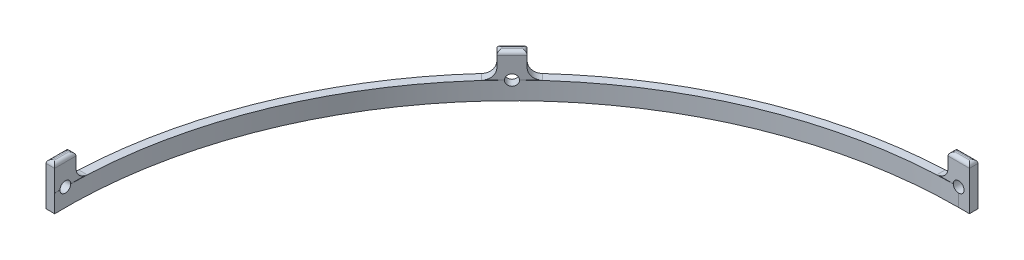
from build123d import *

# Parameters (mm, degrees)
EXTRUDE_1_DEPTH          = 5
SKETCH_2_W               = 2.4
SKETCH_2_H               = 6
SKETCH_2_W_2             = 6
SKETCH_2_H_2             = 2.4
EXTRUDE_2_DEPTH          = 12
FILLET_1_R               = 3
FILLET_2_R               = 3
FILLET_3_R               = 3
FILLET_4_R               = 3
FILLET_5_R               = 3
FILLET_6_R               = 3
FILLET_7_R               = 3
FILLET_8_R               = 3
SKETCH_4_R               = 1.5
CUT_EXTRUDE_1_DEPTH      = 3
PATTERN_CIRCULAR_2_COUNT = 5
PATTERN_CIRCULAR_2_ANGLE = 180
FILLET_9_R               = 1
SKETCH_5_W               = 130.4
SKETCH_5_H               = 124.4
CUT_EXTRUDE_2_DEPTH      = 181.569986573


with BuildPart() as part:
    # Sketch 1 → Extrude 1 (new body)
    with BuildSketch(Plane(origin=(0, 0, 0), x_dir=(1, 0, 0), z_dir=(0, 1, 0))):
        with BuildLine():
            Line((0, 125), (3, 125))
            Line((3, 125), (3, 127.4))
            Line((3, 127.4), (0, 127.4))
            ThreePointArc((0, 127.4), (-127.4, 0), (0, -127.4))
            Line((0, -127.4), (3, -127.4))
            Line((3, -127.4), (3, -125))
            Line((3, -125), (0, -125))
            ThreePointArc((0, -125), (-125, 0), (0, 125))
        make_face()
    extrude(amount=EXTRUDE_1_DEPTH)

    # Sketch 2 → Extrude 2 (add)
    with BuildSketch(Plane(origin=(0, 0, 0), x_dir=(1, 0, 0), z_dir=(0, 1, 0))):
        Polygon((-87.96408358, 92.206724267), (-92.206724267, 87.96408358), (-90.509667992, 86.267027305), (-86.267027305, 90.509667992), align=None)
        with Locations((-126.2, 0)):
            Rectangle(SKETCH_2_W, SKETCH_2_H)
        with Locations((0, 126.2)):
            Rectangle(SKETCH_2_W_2, SKETCH_2_H_2)
        Polygon((-92.206724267, -87.96408358), (-87.96408358, -92.206724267), (-86.267027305, -90.509667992), (-90.509667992, -86.267027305), align=None)
        with Locations((0, -126.2)):
            Rectangle(SKETCH_2_W_2, SKETCH_2_H_2)
    extrude(amount=EXTRUDE_2_DEPTH)

    # Fillet 1
    fillet_1_edges = [part.edges().sort_by_distance(p)[0] for p in [
        (-3, 5, 126.182336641),
    ]]
    fillet(fillet_1_edges, radius=FILLET_1_R)

    # Fillet 2
    fillet_2_edges = [part.edges().sort_by_distance(p)[0] for p in [
        (-87.103065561, 5, 91.345706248),
    ]]
    fillet(fillet_2_edges, radius=FILLET_2_R)

    # Fillet 3
    fillet_3_edges = [part.edges().sort_by_distance(p)[0] for p in [
        (-91.345706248, 5, 87.103065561),
    ]]
    fillet(fillet_3_edges, radius=FILLET_3_R)

    # Fillet 4
    fillet_4_edges = [part.edges().sort_by_distance(p)[0] for p in [
        (-126.182336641, 5, 3),
    ]]
    fillet(fillet_4_edges, radius=FILLET_4_R)

    # Fillet 5
    fillet_5_edges = [part.edges().sort_by_distance(p)[0] for p in [
        (-126.182336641, 5, -3),
    ]]
    fillet(fillet_5_edges, radius=FILLET_5_R)

    # Fillet 6
    fillet_6_edges = [part.edges().sort_by_distance(p)[0] for p in [
        (-91.345706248, 5, -87.103065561),
    ]]
    fillet(fillet_6_edges, radius=FILLET_6_R)

    # Fillet 7
    fillet_7_edges = [part.edges().sort_by_distance(p)[0] for p in [
        (-87.103065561, 5, -91.345706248),
    ]]
    fillet(fillet_7_edges, radius=FILLET_7_R)

    # Fillet 8
    fillet_8_edges = [part.edges().sort_by_distance(p)[0] for p in [
        (-3, 5, -126.182336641),
    ]]
    fillet(fillet_8_edges, radius=FILLET_8_R)

    # Sketch 4 → Cut-Extrude 1 (cut)
    with BuildSketch(Plane.XY.offset(127.4)):
        with Locations((0, 5)):
            Circle(SKETCH_4_R)
    cut_extrude_1 = extrude(amount=-CUT_EXTRUDE_1_DEPTH, mode=Mode.SUBTRACT)

    # Pattern Circular 2: Cut-Extrude 1 ×5 about axis
    pattern_circular_2_axis = Axis((0, 0, 0), (0, -1, 0))
    for i in range(1, PATTERN_CIRCULAR_2_COUNT):
        add(cut_extrude_1.rotate(pattern_circular_2_axis, i * PATTERN_CIRCULAR_2_ANGLE / (PATTERN_CIRCULAR_2_COUNT - 1)), mode=Mode.SUBTRACT)

    # Fillet 9
    fillet_9_edges = [part.edges().sort_by_distance(p)[0] for p in [
        (-87.115555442, 12, 91.358196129),
        (-88.388347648, 12, 88.388347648),
        (-91.358196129, 12, 87.115555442),
        (-90.085403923, 12, 90.085403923),
        (3, 12, 126.2),
        (0, 12, 125),
        (-3, 12, 126.2),
        (0, 12, 127.4),
        (-91.358196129, 12, -87.115555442),
        (-88.388347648, 12, -88.388347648),
        (-87.115555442, 12, -91.358196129),
        (-90.085403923, 12, -90.085403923),
        (-125, 12, 0),
        (-126.2, 12, -3),
        (-127.4, 12, 0),
        (-126.2, 12, 3),
        (-3, 12, -126.2),
        (0, 12, -125),
        (3, 12, -126.2),
        (0, 12, -127.4),
    ]]
    fillet(fillet_9_edges, radius=FILLET_9_R)

    # Sketch 5 → Cut-Extrude 2 (cut, through all)
    with BuildSketch(Plane(origin=(0, 0, 0), x_dir=(1, 0, 0), z_dir=(0, 1, 0))):
        with Locations((-62.2, -65.2)):
            Rectangle(SKETCH_5_W, SKETCH_5_H)
    extrude(amount=CUT_EXTRUDE_2_DEPTH, mode=Mode.SUBTRACT)


solid = part.part
